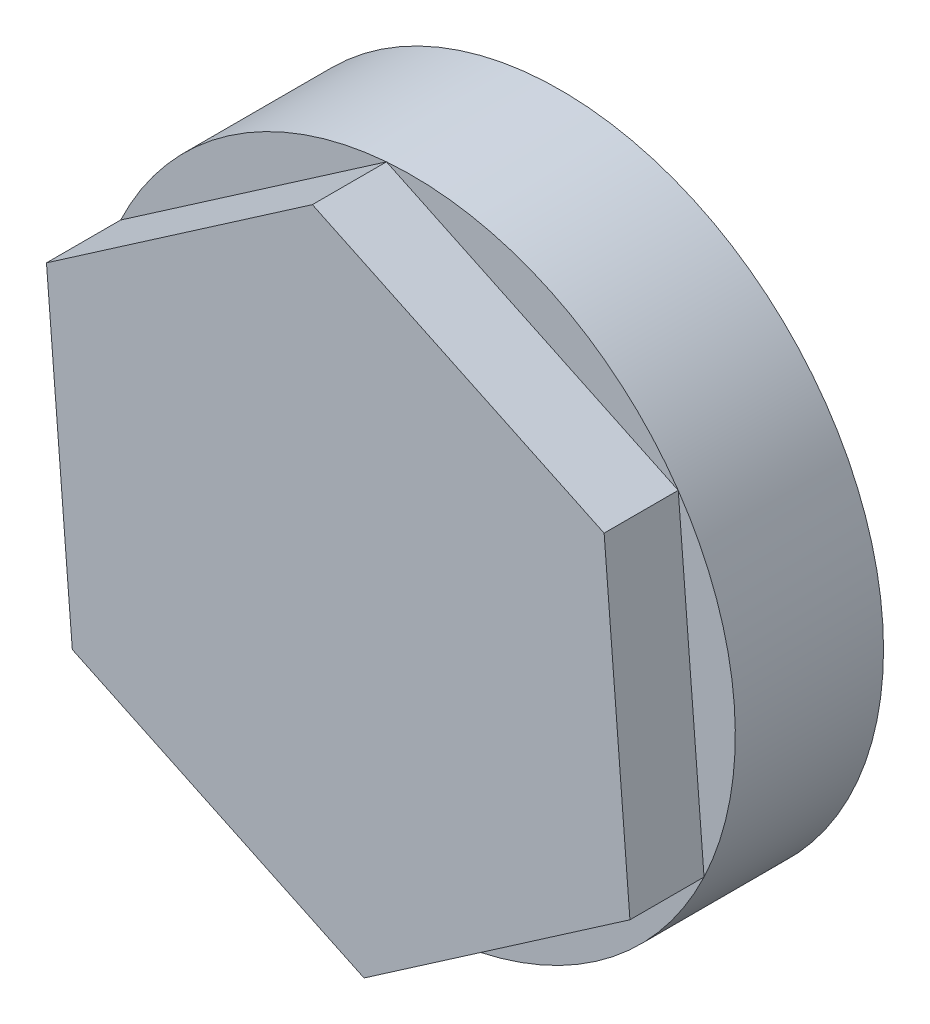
from build123d import *
from build123d.topology import SkipClean

# Parameters (mm, degrees)
SKIZZE1_W                       = 116.556087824
SKIZZE1_H                       = 99.128443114
LINEAR_AUSTRAGEN1_DEPTH         = 5
SKIZZE3_R                       = 21.791957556
LINEAR_AUSTRAGEN3_DEPTH         = 5
LINEAR_AUSTRAGEN2_DEPTH         = 5
SKIZZE4_OUTSIDE_W               = 149.304
SKIZZE4_OUTSIDE_H               = 131.876
SKIZZE4_OUTSIDE_R               = 21.791957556
SCHNITT_LINEAR_AUSTRAGEN1_DEPTH = 5


with BuildPart() as part:
    # Skizze1 → Linear austragen1 (new body)
    with BuildSketch(Plane.XY):
        with Locations((58.278043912, 49.564221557)):
            Rectangle(SKIZZE1_W, SKIZZE1_H)
    extrude(amount=LINEAR_AUSTRAGEN1_DEPTH)

    # Skizze3 → Linear austragen3 (add)
    with BuildSketch(Plane.XY.offset(5)):
        with Locations(Location((39.838602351, 59.671716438, 0), (0, 0, 180))):
            Circle(SKIZZE3_R)
    extrude(amount=LINEAR_AUSTRAGEN3_DEPTH)

    # Skizze2 → Linear austragen2 (add)
    with BuildSketch(Plane.XY.offset(10)):
        Polygon((59.522048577, 50.320173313), (57.778999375, 72.042309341), (38.09555315, 81.393852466), (20.155156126, 69.023259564), (21.898205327, 47.301123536), (41.581651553, 37.94958041), align=None)
    extrude(amount=LINEAR_AUSTRAGEN2_DEPTH)

    # Skizze4 outside → Schnitt-Linear austragen1 (cut)
    with SkipClean():  # the faces are left unmerged after this step: merging them gives an invalid solid
        with BuildSketch(Plane.XY.offset(5)):
            with Locations((58.278, 49.564)):
                Rectangle(SKIZZE4_OUTSIDE_W, SKIZZE4_OUTSIDE_H)
            with Locations(Location((39.838602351, 59.671716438, 0), (0, 0, 154.587754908))):
                Circle(SKIZZE4_OUTSIDE_R, mode=Mode.SUBTRACT)
        extrude(amount=-SCHNITT_LINEAR_AUSTRAGEN1_DEPTH, mode=Mode.SUBTRACT)


solid = part.part
